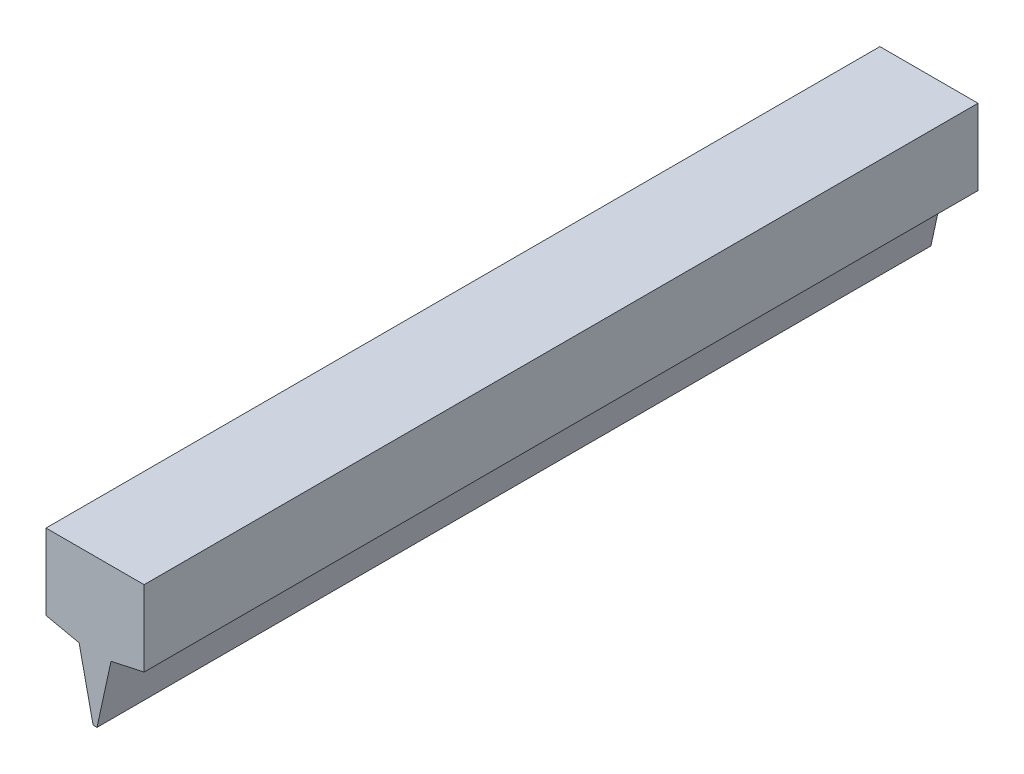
ISO-10303-21;
HEADER;
FILE_DESCRIPTION(('STEP AP214'),'2;1');
FILE_NAME('part.step','',(''),(''),'','','');
FILE_SCHEMA(('AUTOMOTIVE_DESIGN { 1 0 10303 214 1 1 1 1 }'));
ENDSEC;
DATA;
#1=APPLICATION_CONTEXT('core data for automotive mechanical design processes');
#2=APPLICATION_PROTOCOL_DEFINITION('international standard','automotive_design',2000,#1);
#3=PRODUCT_CONTEXT('',#1,'mechanical');
#4=PRODUCT('Part','Part','',(#3));
#5=PRODUCT_RELATED_PRODUCT_CATEGORY('part','',(#4));
#6=PRODUCT_DEFINITION_FORMATION('','',#4);
#7=PRODUCT_DEFINITION_CONTEXT('part definition',#1,'design');
#8=PRODUCT_DEFINITION('design','',#6,#7);
#9=PRODUCT_DEFINITION_SHAPE('','',#8);
#10=(LENGTH_UNIT() NAMED_UNIT(*) SI_UNIT(.MILLI.,.METRE.));
#11=(NAMED_UNIT(*) PLANE_ANGLE_UNIT() SI_UNIT($,.RADIAN.));
#12=(NAMED_UNIT(*) SI_UNIT($,.STERADIAN.) SOLID_ANGLE_UNIT());
#13=UNCERTAINTY_MEASURE_WITH_UNIT(LENGTH_MEASURE(1.E-05),#10,'distance_accuracy_value','');
#14=(GEOMETRIC_REPRESENTATION_CONTEXT(3) GLOBAL_UNCERTAINTY_ASSIGNED_CONTEXT((#13)) GLOBAL_UNIT_ASSIGNED_CONTEXT((#10,
#11,#12)) REPRESENTATION_CONTEXT('',''));
#15=CARTESIAN_POINT('',(0.,0.,0.));
#16=DIRECTION('',(0.,0.,1.));
#17=DIRECTION('',(1.,0.,0.));
#18=AXIS2_PLACEMENT_3D('',#15,#16,#17);
#19=CARTESIAN_POINT('',(-3.175,-4.89884372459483,53.975));
#20=DIRECTION('',(1.,0.,0.));
#21=DIRECTION('',(0.,0.,-1.));
#22=AXIS2_PLACEMENT_3D('',#19,#20,#21);
#23=PLANE('',#22);
#24=DIRECTION('',(0.,-1.,0.));
#25=VECTOR('',#24,1.);
#26=CARTESIAN_POINT('',(-3.175,-4.89884372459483,0.));
#27=LINE('',#26,#25);
#28=CARTESIAN_POINT('',(-3.175,0.,0.));
#29=VERTEX_POINT('',#28);
#30=CARTESIAN_POINT('',(-3.175,-4.89884372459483,0.));
#31=VERTEX_POINT('',#30);
#32=EDGE_CURVE('E130',#29,#31,#27,.T.);
#33=ORIENTED_EDGE('',*,*,#32,.T.);
#34=DIRECTION('',(0.,0.,-1.));
#35=VECTOR('',#34,1.);
#36=CARTESIAN_POINT('',(-3.175,-4.89884372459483,53.975));
#37=LINE('',#36,#35);
#38=CARTESIAN_POINT('',(-3.175,-4.89884372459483,53.975));
#39=VERTEX_POINT('',#38);
#40=EDGE_CURVE('E11',#39,#31,#37,.T.);
#41=ORIENTED_EDGE('',*,*,#40,.F.);
#42=DIRECTION('',(0.,-1.,0.));
#43=VECTOR('',#42,1.);
#44=CARTESIAN_POINT('',(-3.175,-4.89884372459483,53.975));
#45=LINE('',#44,#43);
#46=CARTESIAN_POINT('',(-3.175,0.,53.975));
#47=VERTEX_POINT('',#46);
#48=EDGE_CURVE('E144',#47,#39,#45,.T.);
#49=ORIENTED_EDGE('',*,*,#48,.F.);
#50=DIRECTION('',(0.,0.,-1.));
#51=VECTOR('',#50,1.);
#52=CARTESIAN_POINT('',(-3.175,0.,53.975));
#53=LINE('',#52,#51);
#54=EDGE_CURVE('E126',#47,#29,#53,.T.);
#55=ORIENTED_EDGE('',*,*,#54,.T.);
#56=EDGE_LOOP('',(#33,#41,#49,#55));
#57=FACE_BOUND('',#56,.T.);
#58=ADVANCED_FACE('F34',(#57),#23,.F.);
#59=CARTESIAN_POINT('',(-3.175,-4.89884372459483,53.975));
#60=DIRECTION('',(0.212536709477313,0.977153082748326,0.));
#61=DIRECTION('',(-0.977153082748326,0.212536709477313,0.));
#62=AXIS2_PLACEMENT_3D('',#59,#60,#61);
#63=PLANE('',#62);
#64=DIRECTION('',(0.977153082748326,-0.212536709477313,0.));
#65=VECTOR('',#64,1.);
#66=CARTESIAN_POINT('',(-3.175,-4.89884372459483,0.));
#67=LINE('',#66,#65);
#68=CARTESIAN_POINT('',(-1.03182581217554,-5.36499708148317,0.));
#69=VERTEX_POINT('',#68);
#70=EDGE_CURVE('E133',#31,#69,#67,.T.);
#71=ORIENTED_EDGE('',*,*,#70,.T.);
#72=DIRECTION('',(0.,0.,-1.));
#73=VECTOR('',#72,1.);
#74=CARTESIAN_POINT('',(-1.03182581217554,-5.36499708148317,53.975));
#75=LINE('',#74,#73);
#76=CARTESIAN_POINT('',(-1.03182581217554,-5.36499708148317,53.975));
#77=VERTEX_POINT('',#76);
#78=EDGE_CURVE('E42',#77,#69,#75,.T.);
#79=ORIENTED_EDGE('',*,*,#78,.F.);
#80=DIRECTION('',(0.977153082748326,-0.212536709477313,0.));
#81=VECTOR('',#80,1.);
#82=CARTESIAN_POINT('',(-3.175,-4.89884372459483,53.975));
#83=LINE('',#82,#81);
#84=EDGE_CURVE('E93',#39,#77,#83,.T.);
#85=ORIENTED_EDGE('',*,*,#84,.F.);
#86=ORIENTED_EDGE('',*,*,#40,.T.);
#87=EDGE_LOOP('',(#71,#79,#85,#86));
#88=FACE_BOUND('',#87,.T.);
#89=ADVANCED_FACE('F179',(#88),#63,.F.);
#90=CARTESIAN_POINT('',(-1.03182581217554,-5.36499708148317,53.975));
#91=DIRECTION('',(0.977153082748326,0.212536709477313,0.));
#92=DIRECTION('',(-0.212536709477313,0.977153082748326,0.));
#93=AXIS2_PLACEMENT_3D('',#90,#91,#92);
#94=PLANE('',#93);
#95=DIRECTION('',(0.212536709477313,-0.977153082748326,0.));
#96=VECTOR('',#95,1.);
#97=CARTESIAN_POINT('',(-1.03182581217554,-5.36499708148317,0.));
#98=LINE('',#97,#96);
#99=CARTESIAN_POINT('',(-0.127,-9.525,0.));
#100=VERTEX_POINT('',#99);
#101=EDGE_CURVE('E135',#69,#100,#98,.T.);
#102=ORIENTED_EDGE('',*,*,#101,.T.);
#103=DIRECTION('',(0.,0.,-1.));
#104=VECTOR('',#103,1.);
#105=CARTESIAN_POINT('',(-0.127,-9.525,53.975));
#106=LINE('',#105,#104);
#107=CARTESIAN_POINT('',(-0.127,-9.525,53.975));
#108=VERTEX_POINT('',#107);
#109=EDGE_CURVE('E151',#108,#100,#106,.T.);
#110=ORIENTED_EDGE('',*,*,#109,.F.);
#111=DIRECTION('',(0.212536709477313,-0.977153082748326,0.));
#112=VECTOR('',#111,1.);
#113=CARTESIAN_POINT('',(-1.03182581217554,-5.36499708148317,53.975));
#114=LINE('',#113,#112);
#115=EDGE_CURVE('E159',#77,#108,#114,.T.);
#116=ORIENTED_EDGE('',*,*,#115,.F.);
#117=ORIENTED_EDGE('',*,*,#78,.T.);
#118=EDGE_LOOP('',(#102,#110,#116,#117));
#119=FACE_BOUND('',#118,.T.);
#120=ADVANCED_FACE('F157',(#119),#94,.F.);
#121=CARTESIAN_POINT('',(0.127,-9.525,53.975));
#122=DIRECTION('',(0.,1.,0.));
#123=DIRECTION('',(0.,0.,1.));
#124=AXIS2_PLACEMENT_3D('',#121,#122,#123);
#125=PLANE('',#124);
#126=DIRECTION('',(1.,0.,0.));
#127=VECTOR('',#126,1.);
#128=CARTESIAN_POINT('',(0.127,-9.525,0.));
#129=LINE('',#128,#127);
#130=CARTESIAN_POINT('',(0.127,-9.525,0.));
#131=VERTEX_POINT('',#130);
#132=EDGE_CURVE('E137',#100,#131,#129,.T.);
#133=ORIENTED_EDGE('',*,*,#132,.T.);
#134=DIRECTION('',(0.,0.,-1.));
#135=VECTOR('',#134,1.);
#136=CARTESIAN_POINT('',(0.127,-9.525,53.975));
#137=LINE('',#136,#135);
#138=CARTESIAN_POINT('',(0.127,-9.525,53.975));
#139=VERTEX_POINT('',#138);
#140=EDGE_CURVE('E148',#139,#131,#137,.T.);
#141=ORIENTED_EDGE('',*,*,#140,.F.);
#142=DIRECTION('',(1.,0.,0.));
#143=VECTOR('',#142,1.);
#144=CARTESIAN_POINT('',(0.127,-9.525,53.975));
#145=LINE('',#144,#143);
#146=EDGE_CURVE('E171',#108,#139,#145,.T.);
#147=ORIENTED_EDGE('',*,*,#146,.F.);
#148=ORIENTED_EDGE('',*,*,#109,.T.);
#149=EDGE_LOOP('',(#133,#141,#147,#148));
#150=FACE_BOUND('',#149,.T.);
#151=ADVANCED_FACE('F167',(#150),#125,.F.);
#152=CARTESIAN_POINT('',(0.127,-9.525,53.975));
#153=DIRECTION('',(-0.977153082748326,0.212536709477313,0.));
#154=DIRECTION('',(-0.212536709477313,-0.977153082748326,0.));
#155=AXIS2_PLACEMENT_3D('',#152,#153,#154);
#156=PLANE('',#155);
#157=DIRECTION('',(0.212536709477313,0.977153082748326,0.));
#158=VECTOR('',#157,1.);
#159=CARTESIAN_POINT('',(0.127,-9.525,0.));
#160=LINE('',#159,#158);
#161=CARTESIAN_POINT('',(1.03182581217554,-5.36499708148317,0.));
#162=VERTEX_POINT('',#161);
#163=EDGE_CURVE('E139',#131,#162,#160,.T.);
#164=ORIENTED_EDGE('',*,*,#163,.T.);
#165=DIRECTION('',(0.,0.,-1.));
#166=VECTOR('',#165,1.);
#167=CARTESIAN_POINT('',(1.03182581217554,-5.36499708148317,53.975));
#168=LINE('',#167,#166);
#169=CARTESIAN_POINT('',(1.03182581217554,-5.36499708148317,53.975));
#170=VERTEX_POINT('',#169);
#171=EDGE_CURVE('E121',#170,#162,#168,.T.);
#172=ORIENTED_EDGE('',*,*,#171,.F.);
#173=DIRECTION('',(0.212536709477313,0.977153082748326,0.));
#174=VECTOR('',#173,1.);
#175=CARTESIAN_POINT('',(0.127,-9.525,53.975));
#176=LINE('',#175,#174);
#177=EDGE_CURVE('E112',#139,#170,#176,.T.);
#178=ORIENTED_EDGE('',*,*,#177,.F.);
#179=ORIENTED_EDGE('',*,*,#140,.T.);
#180=EDGE_LOOP('',(#164,#172,#178,#179));
#181=FACE_BOUND('',#180,.T.);
#182=ADVANCED_FACE('F170',(#181),#156,.F.);
#183=CARTESIAN_POINT('',(1.03182581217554,-5.36499708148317,53.975));
#184=DIRECTION('',(-0.212536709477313,0.977153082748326,0.));
#185=DIRECTION('',(-0.977153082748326,-0.212536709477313,0.));
#186=AXIS2_PLACEMENT_3D('',#183,#184,#185);
#187=PLANE('',#186);
#188=DIRECTION('',(0.977153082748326,0.212536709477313,0.));
#189=VECTOR('',#188,1.);
#190=CARTESIAN_POINT('',(1.03182581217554,-5.36499708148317,0.));
#191=LINE('',#190,#189);
#192=CARTESIAN_POINT('',(3.175,-4.89884372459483,0.));
#193=VERTEX_POINT('',#192);
#194=EDGE_CURVE('E120',#162,#193,#191,.T.);
#195=ORIENTED_EDGE('',*,*,#194,.T.);
#196=DIRECTION('',(0.,0.,-1.));
#197=VECTOR('',#196,1.);
#198=CARTESIAN_POINT('',(3.175,-4.89884372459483,53.975));
#199=LINE('',#198,#197);
#200=CARTESIAN_POINT('',(3.175,-4.89884372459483,53.975));
#201=VERTEX_POINT('',#200);
#202=EDGE_CURVE('E117',#201,#193,#199,.T.);
#203=ORIENTED_EDGE('',*,*,#202,.F.);
#204=DIRECTION('',(0.977153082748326,0.212536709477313,0.));
#205=VECTOR('',#204,1.);
#206=CARTESIAN_POINT('',(1.03182581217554,-5.36499708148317,53.975));
#207=LINE('',#206,#205);
#208=EDGE_CURVE('E106',#170,#201,#207,.T.);
#209=ORIENTED_EDGE('',*,*,#208,.F.);
#210=ORIENTED_EDGE('',*,*,#171,.T.);
#211=EDGE_LOOP('',(#195,#203,#209,#210));
#212=FACE_BOUND('',#211,.T.);
#213=ADVANCED_FACE('F118',(#212),#187,.F.);
#214=CARTESIAN_POINT('',(3.175,0.,53.975));
#215=DIRECTION('',(-1.,0.,0.));
#216=DIRECTION('',(0.,0.,1.));
#217=AXIS2_PLACEMENT_3D('',#214,#215,#216);
#218=PLANE('',#217);
#219=DIRECTION('',(0.,1.,0.));
#220=VECTOR('',#219,1.);
#221=CARTESIAN_POINT('',(3.175,0.,0.));
#222=LINE('',#221,#220);
#223=CARTESIAN_POINT('',(3.175,0.,0.));
#224=VERTEX_POINT('',#223);
#225=EDGE_CURVE('E79',#193,#224,#222,.T.);
#226=ORIENTED_EDGE('',*,*,#225,.T.);
#227=DIRECTION('',(0.,0.,-1.));
#228=VECTOR('',#227,1.);
#229=CARTESIAN_POINT('',(3.175,0.,53.975));
#230=LINE('',#229,#228);
#231=CARTESIAN_POINT('',(3.175,0.,53.975));
#232=VERTEX_POINT('',#231);
#233=EDGE_CURVE('E122',#232,#224,#230,.T.);
#234=ORIENTED_EDGE('',*,*,#233,.F.);
#235=DIRECTION('',(0.,1.,0.));
#236=VECTOR('',#235,1.);
#237=CARTESIAN_POINT('',(3.175,0.,53.975));
#238=LINE('',#237,#236);
#239=EDGE_CURVE('E110',#201,#232,#238,.T.);
#240=ORIENTED_EDGE('',*,*,#239,.F.);
#241=ORIENTED_EDGE('',*,*,#202,.T.);
#242=EDGE_LOOP('',(#226,#234,#240,#241));
#243=FACE_BOUND('',#242,.T.);
#244=ADVANCED_FACE('F124',(#243),#218,.F.);
#245=CARTESIAN_POINT('',(-3.175,0.,53.975));
#246=DIRECTION('',(0.,-1.,0.));
#247=DIRECTION('',(0.,0.,-1.));
#248=AXIS2_PLACEMENT_3D('',#245,#246,#247);
#249=PLANE('',#248);
#250=DIRECTION('',(-1.,0.,0.));
#251=VECTOR('',#250,1.);
#252=CARTESIAN_POINT('',(-3.175,0.,0.));
#253=LINE('',#252,#251);
#254=EDGE_CURVE('E85',#224,#29,#253,.T.);
#255=ORIENTED_EDGE('',*,*,#254,.T.);
#256=ORIENTED_EDGE('',*,*,#54,.F.);
#257=DIRECTION('',(-1.,0.,0.));
#258=VECTOR('',#257,1.);
#259=CARTESIAN_POINT('',(-3.175,0.,53.975));
#260=LINE('',#259,#258);
#261=EDGE_CURVE('E50',#232,#47,#260,.T.);
#262=ORIENTED_EDGE('',*,*,#261,.F.);
#263=ORIENTED_EDGE('',*,*,#233,.T.);
#264=EDGE_LOOP('',(#255,#256,#262,#263));
#265=FACE_BOUND('',#264,.T.);
#266=ADVANCED_FACE('F195',(#265),#249,.F.);
#267=CARTESIAN_POINT('',(0.,0.,53.975));
#268=DIRECTION('',(0.,0.,-1.));
#269=DIRECTION('',(-1.,0.,0.));
#270=AXIS2_PLACEMENT_3D('',#267,#268,#269);
#271=PLANE('',#270);
#272=ORIENTED_EDGE('',*,*,#48,.T.);
#273=ORIENTED_EDGE('',*,*,#84,.T.);
#274=ORIENTED_EDGE('',*,*,#115,.T.);
#275=ORIENTED_EDGE('',*,*,#146,.T.);
#276=ORIENTED_EDGE('',*,*,#177,.T.);
#277=ORIENTED_EDGE('',*,*,#208,.T.);
#278=ORIENTED_EDGE('',*,*,#239,.T.);
#279=ORIENTED_EDGE('',*,*,#261,.T.);
#280=EDGE_LOOP('',(#272,#273,#274,#275,#276,#277,#278,#279));
#281=FACE_BOUND('',#280,.T.);
#282=ADVANCED_FACE('F108',(#281),#271,.F.);
#283=CARTESIAN_POINT('',(0.,0.,0.));
#284=DIRECTION('',(0.,0.,-1.));
#285=DIRECTION('',(-1.,0.,0.));
#286=AXIS2_PLACEMENT_3D('',#283,#284,#285);
#287=PLANE('',#286);
#288=ORIENTED_EDGE('',*,*,#32,.F.);
#289=ORIENTED_EDGE('',*,*,#254,.F.);
#290=ORIENTED_EDGE('',*,*,#225,.F.);
#291=ORIENTED_EDGE('',*,*,#194,.F.);
#292=ORIENTED_EDGE('',*,*,#163,.F.);
#293=ORIENTED_EDGE('',*,*,#132,.F.);
#294=ORIENTED_EDGE('',*,*,#101,.F.);
#295=ORIENTED_EDGE('',*,*,#70,.F.);
#296=EDGE_LOOP('',(#288,#289,#290,#291,#292,#293,#294,#295));
#297=FACE_BOUND('',#296,.T.);
#298=ADVANCED_FACE('F163',(#297),#287,.T.);
#299=CLOSED_SHELL('',(#58,#89,#120,#151,#182,#213,#244,#266,#282,#298));
#300=MANIFOLD_SOLID_BREP('B2',#299);
#301=ADVANCED_BREP_SHAPE_REPRESENTATION('',(#18,#300),#14);
#302=SHAPE_DEFINITION_REPRESENTATION(#9,#301);
ENDSEC;
END-ISO-10303-21;
